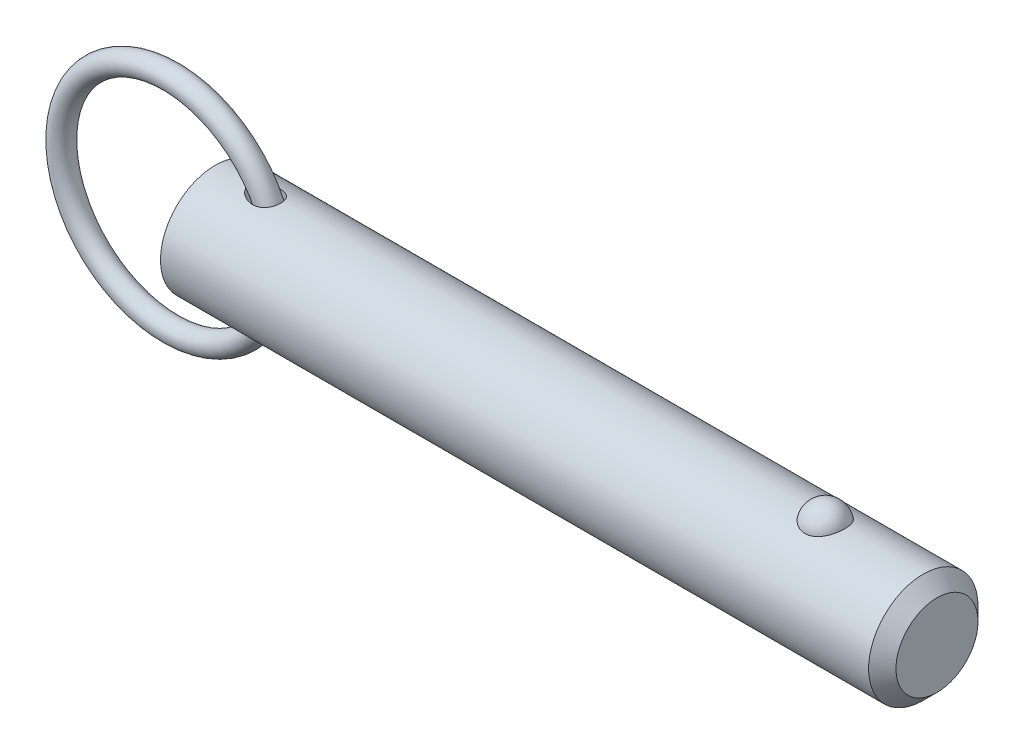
ISO-10303-21;
HEADER;
FILE_DESCRIPTION(('STEP AP214'),'2;1');
FILE_NAME('part.step','',(''),(''),'','','');
FILE_SCHEMA(('AUTOMOTIVE_DESIGN { 1 0 10303 214 1 1 1 1 }'));
ENDSEC;
DATA;
#1=APPLICATION_CONTEXT('core data for automotive mechanical design processes');
#2=APPLICATION_PROTOCOL_DEFINITION('international standard','automotive_design',2000,#1);
#3=PRODUCT_CONTEXT('',#1,'mechanical');
#4=PRODUCT('Part','Part','',(#3));
#5=PRODUCT_RELATED_PRODUCT_CATEGORY('part','',(#4));
#6=PRODUCT_DEFINITION_FORMATION('','',#4);
#7=PRODUCT_DEFINITION_CONTEXT('part definition',#1,'design');
#8=PRODUCT_DEFINITION('design','',#6,#7);
#9=PRODUCT_DEFINITION_SHAPE('','',#8);
#10=(LENGTH_UNIT() NAMED_UNIT(*) SI_UNIT(.MILLI.,.METRE.));
#11=(NAMED_UNIT(*) PLANE_ANGLE_UNIT() SI_UNIT($,.RADIAN.));
#12=(NAMED_UNIT(*) SI_UNIT($,.STERADIAN.) SOLID_ANGLE_UNIT());
#13=UNCERTAINTY_MEASURE_WITH_UNIT(LENGTH_MEASURE(1.E-05),#10,'distance_accuracy_value','');
#14=(GEOMETRIC_REPRESENTATION_CONTEXT(3) GLOBAL_UNCERTAINTY_ASSIGNED_CONTEXT((#13)) GLOBAL_UNIT_ASSIGNED_CONTEXT((#10,
#11,#12)) REPRESENTATION_CONTEXT('',''));
#15=CARTESIAN_POINT('',(0.,0.,0.));
#16=DIRECTION('',(0.,0.,1.));
#17=DIRECTION('',(1.,0.,0.));
#18=AXIS2_PLACEMENT_3D('',#15,#16,#17);
#19=CARTESIAN_POINT('',(-6.46799987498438,0.,0.));
#20=DIRECTION('',(0.,0.,1.));
#21=DIRECTION('',(1.,0.,0.));
#22=AXIS2_PLACEMENT_3D('',#19,#20,#21);
#23=TOROIDAL_SURFACE('',#22,15.875,1.588);
#24=CARTESIAN_POINT('',(10.9950001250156,0.,0.));
#25=VERTEX_POINT('',#24);
#26=VERTEX_LOOP('',#25);
#27=FACE_BOUND('',#26,.T.);
#28=ADVANCED_FACE('P0_F12',(#27),#23,.T.);
#29=CLOSED_SHELL('',(#28));
#30=MANIFOLD_SOLID_BREP('P0_B1',#29);
#31=CARTESIAN_POINT('',(0.,0.,0.));
#32=DIRECTION('',(1.,0.,0.));
#33=DIRECTION('',(0.,0.,-1.));
#34=AXIS2_PLACEMENT_3D('',#31,#32,#33);
#35=CYLINDRICAL_SURFACE('',#34,7.94);
#36=CARTESIAN_POINT('',(5.37881269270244,7.8641200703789,-1.0950869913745));
#37=CARTESIAN_POINT('',(5.49078530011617,7.84653010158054,-1.22142628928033));
#38=CARTESIAN_POINT('',(5.61742164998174,7.82766483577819,-1.33478448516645));
#39=CARTESIAN_POINT('',(5.82155225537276,7.80005811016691,-1.48501770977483));
#40=CARTESIAN_POINT('',(5.89211597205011,7.79095331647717,-1.53186949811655));
#41=CARTESIAN_POINT('',(6.03726296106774,7.77331484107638,-1.61899652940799));
#42=CARTESIAN_POINT('',(6.11184478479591,7.76478095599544,-1.65927412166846));
#43=CARTESIAN_POINT('',(6.31831542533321,7.74290334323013,-1.75933205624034));
#44=CARTESIAN_POINT('',(6.45343253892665,7.73042593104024,-1.81276183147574));
#45=CARTESIAN_POINT('',(6.73017339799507,7.70966096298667,-1.89912673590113));
#46=CARTESIAN_POINT('',(6.87179099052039,7.70136953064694,-1.93208083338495));
#47=CARTESIAN_POINT('',(7.17522096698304,7.6896684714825,-1.97820987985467));
#48=CARTESIAN_POINT('',(7.33750100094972,7.68691980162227,-1.98871513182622));
#49=CARTESIAN_POINT('',(7.5799424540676,7.68880305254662,-1.98137951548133));
#50=CARTESIAN_POINT('',(7.66059155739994,7.69043175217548,-1.97508575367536));
#51=CARTESIAN_POINT('',(7.82077465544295,7.69570110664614,-1.95445819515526));
#52=CARTESIAN_POINT('',(7.90030910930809,7.69934090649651,-1.94012781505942));
#53=CARTESIAN_POINT('',(8.092800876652,7.71066069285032,-1.89475688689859));
#54=CARTESIAN_POINT('',(8.20465204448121,7.71942251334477,-1.85909462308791));
#55=CARTESIAN_POINT('',(8.42059371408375,7.74035594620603,-1.7699066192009));
#56=CARTESIAN_POINT('',(8.52468939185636,7.75252525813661,-1.7163929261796));
#57=CARTESIAN_POINT('',(8.72211003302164,7.77903750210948,-1.59192358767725));
#58=CARTESIAN_POINT('',(8.81539818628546,7.79338749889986,-1.52091076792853));
#59=CARTESIAN_POINT('',(8.98759177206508,7.8225086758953,-1.36321590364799));
#60=CARTESIAN_POINT('',(9.06649712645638,7.83727985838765,-1.27653377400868));
#61=CARTESIAN_POINT('',(9.20311499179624,7.86453692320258,-1.09567667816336));
#62=CARTESIAN_POINT('',(9.26180839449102,7.8771064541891,-1.00225329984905));
#63=CARTESIAN_POINT('',(9.36257622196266,7.89954213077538,-0.806547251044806));
#64=CARTESIAN_POINT('',(9.40465301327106,7.9094086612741,-0.704265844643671));
#65=CARTESIAN_POINT('',(9.47062404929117,7.92520709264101,-0.495461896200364));
#66=CARTESIAN_POINT('',(9.4947881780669,7.9311972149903,-0.38902885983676));
#67=CARTESIAN_POINT('',(9.52544004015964,7.93883641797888,-0.17349446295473));
#68=CARTESIAN_POINT('',(9.53192786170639,7.94048552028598,-0.0643931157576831));
#69=CARTESIAN_POINT('',(9.52707996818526,7.93926454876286,0.153487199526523));
#70=CARTESIAN_POINT('',(9.51572796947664,7.93639034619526,0.262265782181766));
#71=CARTESIAN_POINT('',(9.47542322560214,7.92642470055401,0.47631311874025));
#72=CARTESIAN_POINT('',(9.44647056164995,7.91933327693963,0.581581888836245));
#73=CARTESIAN_POINT('',(9.37164011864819,7.90170355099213,0.785602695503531));
#74=CARTESIAN_POINT('',(9.32576415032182,7.89116561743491,0.884355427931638));
#75=CARTESIAN_POINT('',(9.21823065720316,7.8677977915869,1.07254831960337));
#76=CARTESIAN_POINT('',(9.15657431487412,7.85496807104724,1.16198917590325));
#77=CARTESIAN_POINT('',(9.01919194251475,7.82843688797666,1.32903649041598));
#78=CARTESIAN_POINT('',(8.94347744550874,7.81473614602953,1.40665255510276));
#79=CARTESIAN_POINT('',(8.78012086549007,7.7879321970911,1.5481977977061));
#80=CARTESIAN_POINT('',(8.69247914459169,7.77482897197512,1.61212739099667));
#81=CARTESIAN_POINT('',(8.50642314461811,7.75037063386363,1.72592270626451));
#82=CARTESIAN_POINT('',(8.40786430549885,7.73904540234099,1.77555777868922));
#83=CARTESIAN_POINT('',(8.20398708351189,7.71943979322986,1.85894844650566));
#84=CARTESIAN_POINT('',(8.0986670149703,7.7111601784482,1.89270006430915));
#85=CARTESIAN_POINT('',(7.87703213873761,7.69782475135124,1.94625652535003));
#86=CARTESIAN_POINT('',(7.76044899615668,7.69301557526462,1.96500324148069));
#87=CARTESIAN_POINT('',(7.52574256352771,7.68770484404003,1.98567257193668));
#88=CARTESIAN_POINT('',(7.40761868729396,7.68720497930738,1.98758858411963));
#89=CARTESIAN_POINT('',(7.15639592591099,7.69044495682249,1.97502233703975));
#90=CARTESIAN_POINT('',(7.02341871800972,7.69476380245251,1.9583009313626));
#91=CARTESIAN_POINT('',(6.76125891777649,7.70776394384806,1.90648094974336));
#92=CARTESIAN_POINT('',(6.63208047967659,7.71644984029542,1.87136299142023));
#93=CARTESIAN_POINT('',(6.35978215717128,7.73875442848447,1.77707737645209));
#94=CARTESIAN_POINT('',(6.2177212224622,7.75293863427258,1.71496895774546));
#95=CARTESIAN_POINT('',(5.94559201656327,7.78383102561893,1.56880760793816));
#96=CARTESIAN_POINT('',(5.81552062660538,7.80053855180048,1.48476040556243));
#97=CARTESIAN_POINT('',(5.60081087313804,7.83035955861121,1.31701356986));
#98=CARTESIAN_POINT('',(5.51265224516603,7.84340226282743,1.23780647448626));
#99=CARTESIAN_POINT('',(5.34976240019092,7.86852524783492,1.06647953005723));
#100=CARTESIAN_POINT('',(5.27500719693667,7.88060722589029,0.974383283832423));
#101=CARTESIAN_POINT('',(5.15877594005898,7.89990441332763,0.800548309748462));
#102=CARTESIAN_POINT('',(5.11360209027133,7.90759876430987,0.721348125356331));
#103=CARTESIAN_POINT('',(5.03655060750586,7.92090267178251,0.556518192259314));
#104=CARTESIAN_POINT('',(5.00466157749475,7.92651401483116,0.470894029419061));
#105=CARTESIAN_POINT('',(4.95653766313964,7.93503671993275,0.294356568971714));
#106=CARTESIAN_POINT('',(4.94043621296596,7.93792505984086,0.203404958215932));
#107=CARTESIAN_POINT('',(4.92605720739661,7.94050250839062,0.0200631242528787));
#108=CARTESIAN_POINT('',(4.92776929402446,7.9401934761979,-0.0723262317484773));
#109=CARTESIAN_POINT('',(4.94742735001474,7.93667454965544,-0.243250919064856));
#110=CARTESIAN_POINT('',(4.96327131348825,7.93384031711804,-0.322048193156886));
#111=CARTESIAN_POINT('',(5.00707570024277,7.92609115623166,-0.476058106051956));
#112=CARTESIAN_POINT('',(5.03503965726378,7.92117562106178,-0.55126969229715));
#113=CARTESIAN_POINT('',(5.10737112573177,7.90866290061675,-0.709995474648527));
#114=CARTESIAN_POINT('',(5.15379379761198,7.90074105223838,-0.792541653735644));
#115=CARTESIAN_POINT('',(5.25820836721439,7.88338732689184,-0.949781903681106));
#116=CARTESIAN_POINT('',(5.31621941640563,7.87395295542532,-1.02446265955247));
#117=CARTESIAN_POINT('',(5.37881269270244,7.8641200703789,-1.0950869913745));
#118=B_SPLINE_CURVE_WITH_KNOTS('',3,(#36,#37,#38,#39,#40,#41,#42,#43,#44,#45,#46,#47,#48,#49,
#50,#51,#52,#53,#54,#55,#56,#57,#58,#59,#60,#61,#62,#63,#64,#65,#66,#67,#68,#69,#70,#71,#72,#73,
#74,#75,#76,#77,#78,#79,#80,#81,#82,#83,#84,#85,#86,#87,#88,#89,#90,#91,#92,#93,#94,#95,#96,#97,
#98,#99,#100,#101,#102,#103,#104,#105,#106,#107,#108,#109,#110,#111,#112,#113,#114,#115,#116,
#117),.UNSPECIFIED.,.T.,.F.,(4,2,2,2,2,2,2,2,2,2,2,2,2,2,2,2,2,2,2,2,2,2,2,2,2,2,2,2,2,2,2,2,2,
2,2,2,2,2,2,2,4),(0.,0.508599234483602,0.763935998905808,1.01918131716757,1.45492798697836,
1.89027038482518,2.37502798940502,2.61739702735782,2.8596631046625,3.21120678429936,
3.56251370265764,3.91498401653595,4.26745624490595,4.59897839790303,4.93045331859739,
5.25682643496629,5.58319792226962,5.909867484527,6.23653553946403,6.56316865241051,
6.88977729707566,7.21611917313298,7.54245114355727,7.87378632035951,8.20520442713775,
8.55832700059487,8.91158808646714,9.31234018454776,9.71351536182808,10.1786231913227,
10.6436096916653,11.0001264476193,11.3559986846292,11.6294791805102,11.9027245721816,
12.1782599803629,12.4536351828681,12.693828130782,12.9340911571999,13.2179277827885,
13.5022374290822),.UNSPECIFIED.);
#119=CARTESIAN_POINT('',(5.37881269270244,7.8641200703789,-1.0950869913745));
#120=VERTEX_POINT('',#119);
#121=EDGE_CURVE('P1_E40',#120,#120,#118,.T.);
#122=ORIENTED_EDGE('',*,*,#121,.T.);
#123=EDGE_LOOP('',(#122));
#124=FACE_BOUND('',#123,.T.);
#125=CARTESIAN_POINT('',(102.795,0.,0.));
#126=DIRECTION('',(1.,0.,0.));
#127=DIRECTION('',(0.,0.,-1.));
#128=AXIS2_PLACEMENT_3D('',#125,#126,#127);
#129=CIRCLE('',#128,7.94);
#130=CARTESIAN_POINT('',(102.795,0.,-7.94));
#131=VERTEX_POINT('',#130);
#132=EDGE_CURVE('P1_E25',#131,#131,#129,.T.);
#133=ORIENTED_EDGE('',*,*,#132,.F.);
#134=EDGE_LOOP('',(#133));
#135=FACE_BOUND('',#134,.T.);
#136=CARTESIAN_POINT('',(0.,0.,0.));
#137=DIRECTION('',(1.,0.,0.));
#138=DIRECTION('',(0.,0.,-1.));
#139=AXIS2_PLACEMENT_3D('',#136,#137,#138);
#140=CIRCLE('',#139,7.94);
#141=CARTESIAN_POINT('',(0.,0.,-7.94));
#142=VERTEX_POINT('',#141);
#143=EDGE_CURVE('P1_E9',#142,#142,#140,.T.);
#144=ORIENTED_EDGE('',*,*,#143,.T.);
#145=EDGE_LOOP('',(#144));
#146=FACE_BOUND('',#145,.T.);
#147=CARTESIAN_POINT('',(88.5649074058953,7.37767842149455,2.93486986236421));
#148=CARTESIAN_POINT('',(88.4127496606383,7.3776732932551,2.93487505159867));
#149=CARTESIAN_POINT('',(88.2606329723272,7.38258419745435,2.92262454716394));
#150=CARTESIAN_POINT('',(87.9609284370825,7.40163229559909,2.87404196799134));
#151=CARTESIAN_POINT('',(87.8133394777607,7.41576720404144,2.83771585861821));
#152=CARTESIAN_POINT('',(87.5270187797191,7.4516157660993,2.74218769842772));
#153=CARTESIAN_POINT('',(87.3882745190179,7.47331841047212,2.68301886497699));
#154=CARTESIAN_POINT('',(87.1228822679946,7.52194082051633,2.5435096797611));
#155=CARTESIAN_POINT('',(86.9962366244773,7.5488615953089,2.46316523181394));
#156=CARTESIAN_POINT('',(86.7545349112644,7.60594671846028,2.28090375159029));
#157=CARTESIAN_POINT('',(86.6399065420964,7.63618114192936,2.17844211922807));
#158=CARTESIAN_POINT('',(86.4288787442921,7.69614046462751,1.95608495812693));
#159=CARTESIAN_POINT('',(86.3324826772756,7.72586526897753,1.83618622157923));
#160=CARTESIAN_POINT('',(86.1559381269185,7.78314821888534,1.57628086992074));
#161=CARTESIAN_POINT('',(86.0767072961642,7.81055035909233,1.43561546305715));
#162=CARTESIAN_POINT('',(85.9417979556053,7.85879631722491,1.14236334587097));
#163=CARTESIAN_POINT('',(85.8861216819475,7.87963951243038,0.989775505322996));
#164=CARTESIAN_POINT('',(85.7988121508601,7.91289645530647,0.67461992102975));
#165=CARTESIAN_POINT('',(85.7675309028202,7.925186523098,0.511941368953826));
#166=CARTESIAN_POINT('',(85.730975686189,7.93958930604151,0.183247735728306));
#167=CARTESIAN_POINT('',(85.7257012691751,7.94170219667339,0.0172327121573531));
#168=CARTESIAN_POINT('',(85.7412311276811,7.93554931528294,-0.312672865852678));
#169=CARTESIAN_POINT('',(85.7619253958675,7.92732732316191,-0.476569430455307));
#170=CARTESIAN_POINT('',(85.8287865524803,7.90141534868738,-0.798305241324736));
#171=CARTESIAN_POINT('',(85.8749539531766,7.88372517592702,-0.956144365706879));
#172=CARTESIAN_POINT('',(85.9918986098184,7.84066230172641,-1.26152073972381));
#173=CARTESIAN_POINT('',(86.0627046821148,7.81528060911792,-1.40904568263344));
#174=CARTESIAN_POINT('',(86.2274789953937,7.7594867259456,-1.68950598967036));
#175=CARTESIAN_POINT('',(86.3214488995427,7.72907417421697,-1.82244030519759));
#176=CARTESIAN_POINT('',(86.5308391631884,7.66640424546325,-2.07032792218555));
#177=CARTESIAN_POINT('',(86.6463152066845,7.63414223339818,-2.1852330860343));
#178=CARTESIAN_POINT('',(86.8959006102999,7.57149681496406,-2.39329737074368));
#179=CARTESIAN_POINT('',(87.0300080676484,7.54111321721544,-2.48645870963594));
#180=CARTESIAN_POINT('',(87.3101113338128,7.48650742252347,-2.64628132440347));
#181=CARTESIAN_POINT('',(87.4557605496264,7.46215900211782,-2.71350554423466));
#182=CARTESIAN_POINT('',(87.7574259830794,7.42171253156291,-2.82226614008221));
#183=CARTESIAN_POINT('',(87.9134383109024,7.40561140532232,-2.86381209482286));
#184=CARTESIAN_POINT('',(88.2229708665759,7.38426796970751,-2.91839077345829));
#185=CARTESIAN_POINT('',(88.3762229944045,7.37852109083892,-2.93275024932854));
#186=CARTESIAN_POINT('',(88.6830705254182,7.37700973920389,-2.9365520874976));
#187=CARTESIAN_POINT('',(88.8366658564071,7.38124333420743,-2.92599927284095));
#188=CARTESIAN_POINT('',(89.1349907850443,7.39890635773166,-2.88102897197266));
#189=CARTESIAN_POINT('',(89.2798480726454,7.41205491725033,-2.84733999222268));
#190=CARTESIAN_POINT('',(89.5616432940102,7.445801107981,-2.75788206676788));
#191=CARTESIAN_POINT('',(89.6985805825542,7.46639934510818,-2.70211132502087));
#192=CARTESIAN_POINT('',(89.9640619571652,7.51339098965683,-2.56858908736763));
#193=CARTESIAN_POINT('',(90.0923548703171,7.53990200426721,-2.49038067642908));
#194=CARTESIAN_POINT('',(90.3342440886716,7.59569503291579,-2.31462737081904));
#195=CARTESIAN_POINT('',(90.4478370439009,7.62497767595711,-2.217078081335));
#196=CARTESIAN_POINT('',(90.66322156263,7.68489473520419,-1.99982049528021));
#197=CARTESIAN_POINT('',(90.7641488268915,7.71552419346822,-1.87925337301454));
#198=CARTESIAN_POINT('',(90.9451866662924,7.77353016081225,-1.62268826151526));
#199=CARTESIAN_POINT('',(91.0252934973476,7.80090608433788,-1.48668750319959));
#200=CARTESIAN_POINT('',(91.1653615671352,7.85047992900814,-1.19818413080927));
#201=CARTESIAN_POINT('',(91.2245877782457,7.8724818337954,-1.04529016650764));
#202=CARTESIAN_POINT('',(91.3179821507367,7.90785114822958,-0.731080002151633));
#203=CARTESIAN_POINT('',(91.3521497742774,7.92121837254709,-0.56976362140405));
#204=CARTESIAN_POINT('',(91.394795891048,7.93797834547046,-0.242812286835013));
#205=CARTESIAN_POINT('',(91.4032047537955,7.94134405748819,-0.0771668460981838));
#206=CARTESIAN_POINT('',(91.3939626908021,7.93767937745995,0.253276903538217));
#207=CARTESIAN_POINT('',(91.3763120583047,7.93064910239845,0.418075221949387));
#208=CARTESIAN_POINT('',(91.3154247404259,7.90695571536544,0.741525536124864));
#209=CARTESIAN_POINT('',(91.2722819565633,7.8903279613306,0.900197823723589));
#210=CARTESIAN_POINT('',(91.1613535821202,7.84916386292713,1.20759654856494));
#211=CARTESIAN_POINT('',(91.0935665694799,7.82462706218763,1.35632241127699));
#212=CARTESIAN_POINT('',(90.9343718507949,7.7700669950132,1.64032869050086));
#213=CARTESIAN_POINT('',(90.8428616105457,7.7400200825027,1.77554712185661));
#214=CARTESIAN_POINT('',(90.6382960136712,7.67774175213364,2.02800648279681));
#215=CARTESIAN_POINT('',(90.5252410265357,7.64551037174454,2.14524772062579));
#216=CARTESIAN_POINT('',(90.2808318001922,7.58265895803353,2.35778002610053));
#217=CARTESIAN_POINT('',(90.1495833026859,7.5520309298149,2.45319004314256));
#218=CARTESIAN_POINT('',(89.871601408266,7.49579792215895,2.61999897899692));
#219=CARTESIAN_POINT('',(89.7248670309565,7.47019326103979,2.69139637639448));
#220=CARTESIAN_POINT('',(89.4129477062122,7.42622216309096,2.81053241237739));
#221=CARTESIAN_POINT('',(89.2472209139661,7.40825002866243,2.85700910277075));
#222=CARTESIAN_POINT('',(88.9092792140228,7.38398348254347,2.91916850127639));
#223=CARTESIAN_POINT('',(88.7370670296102,7.3776842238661,2.93486399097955));
#224=CARTESIAN_POINT('',(88.5649074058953,7.37767842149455,2.93486986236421));
#225=B_SPLINE_CURVE_WITH_KNOTS('',3,(#147,#148,#149,#150,#151,#152,#153,#154,#155,#156,#157,
#158,#159,#160,#161,#162,#163,#164,#165,#166,#167,#168,#169,#170,#171,#172,#173,#174,#175,#176,
#177,#178,#179,#180,#181,#182,#183,#184,#185,#186,#187,#188,#189,#190,#191,#192,#193,#194,#195,
#196,#197,#198,#199,#200,#201,#202,#203,#204,#205,#206,#207,#208,#209,#210,#211,#212,#213,#214,
#215,#216,#217,#218,#219,#220,#221,#222,#223,#224),.UNSPECIFIED.,.T.,.F.,(4,2,2,2,2,2,2,2,2,2,2,
2,2,2,2,2,2,2,2,2,2,2,2,2,2,2,2,2,2,2,2,2,2,2,2,2,2,2,4),(0.,0.455841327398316,
0.911569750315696,1.36663794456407,1.8217942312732,2.28978983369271,2.75787163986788,
3.24685368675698,3.73588214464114,4.23184282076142,4.72779494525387,5.22165321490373,
5.71552141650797,6.20996917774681,6.70445245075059,7.20023431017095,7.69596557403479,
8.18023418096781,8.66432203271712,9.12410697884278,9.58380291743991,10.0296503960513,
10.4755341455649,10.9312349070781,11.3870393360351,11.8654416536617,12.343929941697,
12.837887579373,13.3318558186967,13.8271581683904,14.3224549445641,14.8159385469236,
15.309450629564,15.8051323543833,16.3008055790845,16.7937101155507,17.2866458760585,
17.8026240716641,18.3183879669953),.UNSPECIFIED.);
#226=CARTESIAN_POINT('',(88.5649074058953,7.37767842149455,2.93486986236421));
#227=VERTEX_POINT('',#226);
#228=EDGE_CURVE('P1_E34',#227,#227,#225,.T.);
#229=ORIENTED_EDGE('',*,*,#228,.T.);
#230=EDGE_LOOP('',(#229));
#231=FACE_BOUND('',#230,.T.);
#232=CARTESIAN_POINT('',(5.37881269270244,-7.8641200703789,-1.0950869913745));
#233=CARTESIAN_POINT('',(5.31532711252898,-7.87409326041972,-1.02345575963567));
#234=CARTESIAN_POINT('',(5.25654962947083,-7.88365715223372,-0.947641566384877));
#235=CARTESIAN_POINT('',(5.15093536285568,-7.90122221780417,-0.787865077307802));
#236=CARTESIAN_POINT('',(5.10408931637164,-7.90922460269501,-0.703909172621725));
#237=CARTESIAN_POINT('',(5.02499142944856,-7.92292057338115,-0.5279916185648));
#238=CARTESIAN_POINT('',(4.99290048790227,-7.92858863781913,-0.435954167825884));
#239=CARTESIAN_POINT('',(4.94718343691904,-7.93670712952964,-0.247266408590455));
#240=CARTESIAN_POINT('',(4.93353142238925,-7.93916207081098,-0.150622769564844));
#241=CARTESIAN_POINT('',(4.92669426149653,-7.94038957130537,0.0306459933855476));
#242=CARTESIAN_POINT('',(4.9310562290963,-7.93960347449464,0.115182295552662));
#243=CARTESIAN_POINT('',(4.95441758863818,-7.93542535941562,0.2821331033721));
#244=CARTESIAN_POINT('',(4.97342060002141,-7.93203269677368,0.364547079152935));
#245=CARTESIAN_POINT('',(5.02337664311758,-7.92322764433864,0.521528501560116));
#246=CARTESIAN_POINT('',(5.05377582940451,-7.91790920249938,0.596281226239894));
#247=CARTESIAN_POINT('',(5.1246872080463,-7.90571364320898,0.740640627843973));
#248=CARTESIAN_POINT('',(5.16520358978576,-7.89883588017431,0.810245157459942));
#249=CARTESIAN_POINT('',(5.27792634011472,-7.88012470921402,0.97862022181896));
#250=CARTESIAN_POINT('',(5.35563200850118,-7.86757912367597,1.07363778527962));
#251=CARTESIAN_POINT('',(5.52523836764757,-7.84150676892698,1.24994147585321));
#252=CARTESIAN_POINT('',(5.61717506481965,-7.82797755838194,1.33119164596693));
#253=CARTESIAN_POINT('',(5.83913717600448,-7.79742756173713,1.50104748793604));
#254=CARTESIAN_POINT('',(5.97257429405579,-7.78050347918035,1.58521567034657));
#255=CARTESIAN_POINT('',(6.25160600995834,-7.74942135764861,1.73078109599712));
#256=CARTESIAN_POINT('',(6.39720857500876,-7.73526515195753,1.79216327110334));
#257=CARTESIAN_POINT('',(6.69793322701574,-7.7116170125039,1.89134478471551));
#258=CARTESIAN_POINT('',(6.85312134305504,-7.70216275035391,1.92895428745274));
#259=CARTESIAN_POINT('',(7.16781951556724,-7.68988337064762,1.97736316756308));
#260=CARTESIAN_POINT('',(7.32732244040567,-7.68704791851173,1.98820434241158));
#261=CARTESIAN_POINT('',(7.61290770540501,-7.68890797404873,1.98097687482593));
#262=CARTESIAN_POINT('',(7.73913797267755,-7.69217875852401,1.96837928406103));
#263=CARTESIAN_POINT('',(7.98774248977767,-7.70364253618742,1.92303262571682));
#264=CARTESIAN_POINT('',(8.11011880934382,-7.71183283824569,1.89029457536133));
#265=CARTESIAN_POINT('',(8.34766306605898,-7.73253074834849,1.80375920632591));
#266=CARTESIAN_POINT('',(8.46278682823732,-7.74506226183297,1.74984505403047));
#267=CARTESIAN_POINT('',(8.6806268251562,-7.77294147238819,1.62149891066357));
#268=CARTESIAN_POINT('',(8.78334736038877,-7.78828818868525,1.54707406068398));
#269=CARTESIAN_POINT('',(8.96275951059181,-7.81808719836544,1.38814746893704));
#270=CARTESIAN_POINT('',(9.04102925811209,-7.83247448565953,1.30540890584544));
#271=CARTESIAN_POINT('',(9.18176824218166,-7.86008608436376,1.1272733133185));
#272=CARTESIAN_POINT('',(9.24424163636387,-7.87331070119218,1.03187962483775));
#273=CARTESIAN_POINT('',(9.34924815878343,-7.89649032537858,0.83568428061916));
#274=CARTESIAN_POINT('',(9.39252490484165,-7.90656172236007,0.735293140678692));
#275=CARTESIAN_POINT('',(9.46188913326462,-7.92307290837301,0.528458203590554));
#276=CARTESIAN_POINT('',(9.48797767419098,-7.92951292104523,0.422014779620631));
#277=CARTESIAN_POINT('',(9.52228670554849,-7.93804067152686,0.206589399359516));
#278=CARTESIAN_POINT('',(9.53058328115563,-7.94014694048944,0.0976202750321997));
#279=CARTESIAN_POINT('',(9.52935292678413,-7.93983698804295,-0.120212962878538));
#280=CARTESIAN_POINT('',(9.51982577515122,-7.93742071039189,-0.229077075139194));
#281=CARTESIAN_POINT('',(9.48313466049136,-7.92831916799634,-0.443751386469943));
#282=CARTESIAN_POINT('',(9.45594838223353,-7.92162850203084,-0.549557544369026));
#283=CARTESIAN_POINT('',(9.38454658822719,-7.90469917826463,-0.754954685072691));
#284=CARTESIAN_POINT('',(9.34033171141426,-7.89446065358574,-0.854545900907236));
#285=CARTESIAN_POINT('',(9.23602927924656,-7.87157146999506,-1.04456732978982));
#286=CARTESIAN_POINT('',(9.17596171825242,-7.85892385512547,-1.13500888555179));
#287=CARTESIAN_POINT('',(9.0415343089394,-7.83259746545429,-1.30436780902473));
#288=CARTESIAN_POINT('',(8.96717562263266,-7.81891877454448,-1.38328611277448));
#289=CARTESIAN_POINT('',(8.80603455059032,-7.79196869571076,-1.52782923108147));
#290=CARTESIAN_POINT('',(8.71921490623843,-7.77869867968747,-1.59341269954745));
#291=CARTESIAN_POINT('',(8.53589430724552,-7.7539823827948,-1.7096493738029));
#292=CARTESIAN_POINT('',(8.43939269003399,-7.74253622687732,-1.76030155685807));
#293=CARTESIAN_POINT('',(8.23614706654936,-7.72219212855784,-1.84754820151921));
#294=CARTESIAN_POINT('',(8.1291686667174,-7.71339202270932,-1.88361685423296));
#295=CARTESIAN_POINT('',(7.91082287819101,-7.69955300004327,-1.93940887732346));
#296=CARTESIAN_POINT('',(7.79945379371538,-7.69451555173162,-1.95912586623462));
#297=CARTESIAN_POINT('',(7.56409927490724,-7.6881073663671,-1.98413612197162));
#298=CARTESIAN_POINT('',(7.43993744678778,-7.68713944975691,-1.98784574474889));
#299=CARTESIAN_POINT('',(7.19239878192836,-7.68969629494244,-1.97792309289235));
#300=CARTESIAN_POINT('',(7.0690222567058,-7.69322274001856,-1.96428432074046));
#301=CARTESIAN_POINT('',(6.80624991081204,-7.70498367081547,-1.91768089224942));
#302=CARTESIAN_POINT('',(6.66736121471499,-7.71386737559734,-1.88203087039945));
#303=CARTESIAN_POINT('',(6.39625444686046,-7.73551250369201,-1.79098714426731));
#304=CARTESIAN_POINT('',(6.26404857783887,-7.74828074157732,-1.73555871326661));
#305=CARTESIAN_POINT('',(6.06559048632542,-7.77003865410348,-1.63446133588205));
#306=CARTESIAN_POINT('',(5.99591479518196,-7.77821880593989,-1.59522999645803));
#307=CARTESIAN_POINT('',(5.86025875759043,-7.79503524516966,-1.51091846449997));
#308=CARTESIAN_POINT('',(5.79427944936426,-7.8036716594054,-1.46583664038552));
#309=CARTESIAN_POINT('',(5.60322733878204,-7.82978128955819,-1.3219827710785));
#310=CARTESIAN_POINT('',(5.4844964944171,-7.84751780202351,-1.21433077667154));
#311=CARTESIAN_POINT('',(5.37881269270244,-7.8641200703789,-1.0950869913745));
#312=B_SPLINE_CURVE_WITH_KNOTS('',3,(#232,#233,#234,#235,#236,#237,#238,#239,#240,#241,#242,
#243,#244,#245,#246,#247,#248,#249,#250,#251,#252,#253,#254,#255,#256,#257,#258,#259,#260,#261,
#262,#263,#264,#265,#266,#267,#268,#269,#270,#271,#272,#273,#274,#275,#276,#277,#278,#279,#280,
#281,#282,#283,#284,#285,#286,#287,#288,#289,#290,#291,#292,#293,#294,#295,#296,#297,#298,#299,
#300,#301,#302,#303,#304,#305,#306,#307,#308,#309,#310,#311),.UNSPECIFIED.,.T.,.F.,(4,2,2,2,2,2,
2,2,2,2,2,2,2,2,2,2,2,2,2,2,2,2,2,2,2,2,2,2,2,2,2,2,2,2,2,2,2,2,2,4),(0.,0.288363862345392,
0.576503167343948,0.867714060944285,1.15851540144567,1.41111828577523,1.66378363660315,
1.90549406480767,2.1473047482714,2.51540453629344,2.88445136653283,3.35805159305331,
3.83196445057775,4.30961543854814,4.78652012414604,5.16565662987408,5.54458592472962,
5.92563591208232,6.30655339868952,6.64920782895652,6.99177197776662,7.31956587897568,
7.64733959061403,7.97370879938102,8.30008206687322,8.62686856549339,8.95364280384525,
9.28000684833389,9.60634436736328,9.93367879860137,10.261035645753,10.59932199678,
10.9377403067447,11.308967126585,11.6803330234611,12.1096921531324,12.5398088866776,
12.7806650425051,13.0215885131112,13.5016249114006),.UNSPECIFIED.);
#313=CARTESIAN_POINT('',(5.37881269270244,-7.8641200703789,-1.0950869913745));
#314=VERTEX_POINT('',#313);
#315=EDGE_CURVE('P1_E17',#314,#314,#312,.T.);
#316=ORIENTED_EDGE('',*,*,#315,.T.);
#317=EDGE_LOOP('',(#316));
#318=FACE_BOUND('',#317,.T.);
#319=ADVANCED_FACE('P1_F13',(#124,#135,#146,#231,#318),#35,.T.);
#320=CARTESIAN_POINT('',(0.,0.,0.));
#321=DIRECTION('',(-1.,0.,0.));
#322=DIRECTION('',(0.,0.,1.));
#323=AXIS2_PLACEMENT_3D('',#320,#321,#322);
#324=PLANE('',#323);
#325=ORIENTED_EDGE('',*,*,#143,.F.);
#326=EDGE_LOOP('',(#325));
#327=FACE_BOUND('',#326,.T.);
#328=ADVANCED_FACE('P1_F15',(#327),#324,.T.);
#329=CARTESIAN_POINT('',(104.78,0.,0.));
#330=DIRECTION('',(-1.,0.,0.));
#331=DIRECTION('',(0.,0.,1.));
#332=AXIS2_PLACEMENT_3D('',#329,#330,#331);
#333=CONICAL_SURFACE('',#332,5.95500000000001,0.785398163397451);
#334=ORIENTED_EDGE('',*,*,#132,.T.);
#335=EDGE_LOOP('',(#334));
#336=FACE_BOUND('',#335,.T.);
#337=CARTESIAN_POINT('',(104.78,0.,0.));
#338=DIRECTION('',(1.,0.,0.));
#339=DIRECTION('',(0.,0.,-1.));
#340=AXIS2_PLACEMENT_3D('',#337,#338,#339);
#341=CIRCLE('',#340,5.95500000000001);
#342=CARTESIAN_POINT('',(104.78,0.,-5.95500000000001));
#343=VERTEX_POINT('',#342);
#344=EDGE_CURVE('P1_E30',#343,#343,#341,.T.);
#345=ORIENTED_EDGE('',*,*,#344,.F.);
#346=EDGE_LOOP('',(#345));
#347=FACE_BOUND('',#346,.T.);
#348=ADVANCED_FACE('P1_F55',(#336,#347),#333,.T.);
#349=CARTESIAN_POINT('',(104.78,5.95500000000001,0.));
#350=DIRECTION('',(1.,0.,0.));
#351=DIRECTION('',(0.,0.,-1.));
#352=AXIS2_PLACEMENT_3D('',#349,#350,#351);
#353=PLANE('',#352);
#354=ORIENTED_EDGE('',*,*,#344,.T.);
#355=EDGE_LOOP('',(#354));
#356=FACE_BOUND('',#355,.T.);
#357=ADVANCED_FACE('P1_F51',(#356),#353,.T.);
#358=CARTESIAN_POINT('',(88.5649074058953,7.146,0.));
#359=DIRECTION('',(-1.,0.,0.));
#360=DIRECTION('',(0.,1.,0.));
#361=AXIS2_PLACEMENT_3D('',#358,#359,#360);
#362=SPHERICAL_SURFACE('',#361,2.94399999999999);
#363=ORIENTED_EDGE('',*,*,#228,.F.);
#364=EDGE_LOOP('',(#363));
#365=FACE_BOUND('',#364,.T.);
#366=ADVANCED_FACE('P1_F46',(#365),#362,.T.);
#367=CARTESIAN_POINT('',(-6.46799987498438,0.,0.));
#368=DIRECTION('',(0.,0.,1.));
#369=DIRECTION('',(1.,0.,0.));
#370=AXIS2_PLACEMENT_3D('',#367,#368,#369);
#371=TOROIDAL_SURFACE('',#370,15.875,1.985);
#372=ORIENTED_EDGE('',*,*,#315,.F.);
#373=EDGE_LOOP('',(#372));
#374=FACE_BOUND('',#373,.T.);
#375=ORIENTED_EDGE('',*,*,#121,.F.);
#376=EDGE_LOOP('',(#375));
#377=FACE_BOUND('',#376,.T.);
#378=ADVANCED_FACE('P1_F50',(#374,#377),#371,.F.);
#379=CLOSED_SHELL('',(#319,#328,#348,#357,#366,#378));
#380=MANIFOLD_SOLID_BREP('P1_B1',#379);
#381=ADVANCED_BREP_SHAPE_REPRESENTATION('',(#18,#30,#380),#14);
#382=SHAPE_DEFINITION_REPRESENTATION(#9,#381);
ENDSEC;
END-ISO-10303-21;
